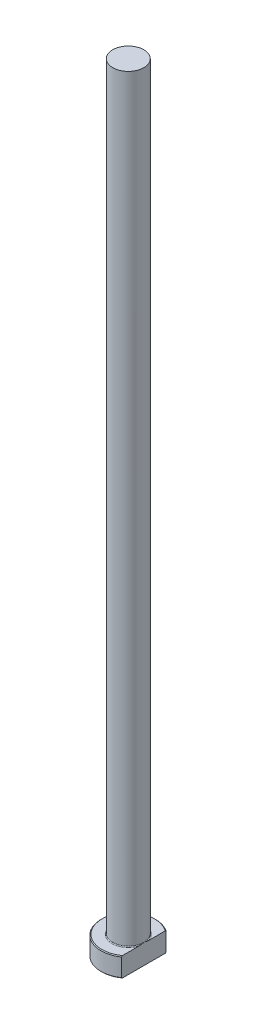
ISO-10303-21;
HEADER;
FILE_DESCRIPTION(('STEP AP214'),'2;1');
FILE_NAME('part.step','',(''),(''),'','','');
FILE_SCHEMA(('AUTOMOTIVE_DESIGN { 1 0 10303 214 1 1 1 1 }'));
ENDSEC;
DATA;
#1=APPLICATION_CONTEXT('core data for automotive mechanical design processes');
#2=APPLICATION_PROTOCOL_DEFINITION('international standard','automotive_design',2000,#1);
#3=PRODUCT_CONTEXT('',#1,'mechanical');
#4=PRODUCT('Part','Part','',(#3));
#5=PRODUCT_RELATED_PRODUCT_CATEGORY('part','',(#4));
#6=PRODUCT_DEFINITION_FORMATION('','',#4);
#7=PRODUCT_DEFINITION_CONTEXT('part definition',#1,'design');
#8=PRODUCT_DEFINITION('design','',#6,#7);
#9=PRODUCT_DEFINITION_SHAPE('','',#8);
#10=(LENGTH_UNIT() NAMED_UNIT(*) SI_UNIT(.MILLI.,.METRE.));
#11=(NAMED_UNIT(*) PLANE_ANGLE_UNIT() SI_UNIT($,.RADIAN.));
#12=(NAMED_UNIT(*) SI_UNIT($,.STERADIAN.) SOLID_ANGLE_UNIT());
#13=UNCERTAINTY_MEASURE_WITH_UNIT(LENGTH_MEASURE(1.E-05),#10,'distance_accuracy_value','');
#14=(GEOMETRIC_REPRESENTATION_CONTEXT(3) GLOBAL_UNCERTAINTY_ASSIGNED_CONTEXT((#13)) GLOBAL_UNIT_ASSIGNED_CONTEXT((#10,
#11,#12)) REPRESENTATION_CONTEXT('',''));
#15=CARTESIAN_POINT('',(0.,0.,0.));
#16=DIRECTION('',(0.,0.,1.));
#17=DIRECTION('',(1.,0.,0.));
#18=AXIS2_PLACEMENT_3D('',#15,#16,#17);
#19=CARTESIAN_POINT('',(0.,0.,0.));
#20=DIRECTION('',(0.,-1.,0.));
#21=DIRECTION('',(0.,0.,-1.));
#22=AXIS2_PLACEMENT_3D('',#19,#20,#21);
#23=PLANE('',#22);
#24=CARTESIAN_POINT('',(0.,0.,0.));
#25=DIRECTION('',(0.,-1.,0.));
#26=DIRECTION('',(0.,0.,-1.));
#27=AXIS2_PLACEMENT_3D('',#24,#25,#26);
#28=CIRCLE('',#27,6.79999999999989);
#29=CARTESIAN_POINT('',(3.99999999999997,0.,5.49909083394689));
#30=VERTEX_POINT('',#29);
#31=CARTESIAN_POINT('',(3.99999999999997,0.,-5.49909083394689));
#32=VERTEX_POINT('',#31);
#33=EDGE_CURVE('E98',#30,#32,#28,.T.);
#34=ORIENTED_EDGE('',*,*,#33,.T.);
#35=DIRECTION('',(0.,0.,1.));
#36=VECTOR('',#35,1.);
#37=CARTESIAN_POINT('',(3.99999999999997,0.,-5.74456264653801));
#38=LINE('',#37,#36);
#39=EDGE_CURVE('E83',#32,#30,#38,.T.);
#40=ORIENTED_EDGE('',*,*,#39,.T.);
#41=EDGE_LOOP('',(#34,#40));
#42=FACE_BOUND('',#41,.T.);
#43=ADVANCED_FACE('F32',(#42),#23,.T.);
#44=CARTESIAN_POINT('',(0.,259.958771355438,0.));
#45=DIRECTION('',(0.,1.,0.));
#46=DIRECTION('',(0.,0.,1.));
#47=AXIS2_PLACEMENT_3D('',#44,#45,#46);
#48=CYLINDRICAL_SURFACE('',#47,6.99999999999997);
#49=CARTESIAN_POINT('',(0.,4.79999999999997,0.));
#50=DIRECTION('',(0.,1.,0.));
#51=DIRECTION('',(0.,0.,1.));
#52=AXIS2_PLACEMENT_3D('',#49,#50,#51);
#53=CIRCLE('',#52,6.99999999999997);
#54=CARTESIAN_POINT('',(3.99999999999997,4.79999999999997,5.74456264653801));
#55=VERTEX_POINT('',#54);
#56=CARTESIAN_POINT('',(3.99999999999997,4.79999999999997,-5.74456264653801));
#57=VERTEX_POINT('',#56);
#58=EDGE_CURVE('E104',#55,#57,#53,.F.);
#59=ORIENTED_EDGE('',*,*,#58,.T.);
#60=DIRECTION('',(0.,-1.,0.));
#61=VECTOR('',#60,1.);
#62=CARTESIAN_POINT('',(3.99999999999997,200.,-5.74456264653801));
#63=LINE('',#62,#61);
#64=CARTESIAN_POINT('',(3.99999999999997,0.200000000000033,-5.74456264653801));
#65=VERTEX_POINT('',#64);
#66=EDGE_CURVE('E183',#57,#65,#63,.T.);
#67=ORIENTED_EDGE('',*,*,#66,.T.);
#68=CARTESIAN_POINT('',(0.,0.200000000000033,0.));
#69=DIRECTION('',(0.,-1.,0.));
#70=DIRECTION('',(0.,0.,-1.));
#71=AXIS2_PLACEMENT_3D('',#68,#69,#70);
#72=CIRCLE('',#71,6.99999999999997);
#73=CARTESIAN_POINT('',(3.99999999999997,0.200000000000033,5.74456264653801));
#74=VERTEX_POINT('',#73);
#75=EDGE_CURVE('E100',#65,#74,#72,.F.);
#76=ORIENTED_EDGE('',*,*,#75,.T.);
#77=DIRECTION('',(0.,-1.,0.));
#78=VECTOR('',#77,1.);
#79=CARTESIAN_POINT('',(3.99999999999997,200.,5.74456264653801));
#80=LINE('',#79,#78);
#81=EDGE_CURVE('E93',#55,#74,#80,.T.);
#82=ORIENTED_EDGE('',*,*,#81,.F.);
#83=EDGE_LOOP('',(#59,#67,#76,#82));
#84=FACE_BOUND('',#83,.T.);
#85=ADVANCED_FACE('F158',(#84),#48,.T.);
#86=CARTESIAN_POINT('',(-6.99999999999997,5.,0.));
#87=DIRECTION('',(0.,1.,0.));
#88=DIRECTION('',(0.,0.,1.));
#89=AXIS2_PLACEMENT_3D('',#86,#87,#88);
#90=PLANE('',#89);
#91=CARTESIAN_POINT('',(0.,5.,0.));
#92=DIRECTION('',(0.,1.,0.));
#93=DIRECTION('',(0.,0.,1.));
#94=AXIS2_PLACEMENT_3D('',#91,#92,#93);
#95=CIRCLE('',#94,6.79999999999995);
#96=CARTESIAN_POINT('',(3.99999999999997,5.,-5.49909083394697));
#97=VERTEX_POINT('',#96);
#98=CARTESIAN_POINT('',(3.99999999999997,5.,5.49909083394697));
#99=VERTEX_POINT('',#98);
#100=EDGE_CURVE('E178',#97,#99,#95,.T.);
#101=ORIENTED_EDGE('',*,*,#100,.T.);
#102=DIRECTION('',(0.,0.,-1.));
#103=VECTOR('',#102,1.);
#104=CARTESIAN_POINT('',(3.99999999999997,5.,0.));
#105=LINE('',#104,#103);
#106=CARTESIAN_POINT('',(3.99999999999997,4.99999999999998,1.28062484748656));
#107=VERTEX_POINT('',#106);
#108=EDGE_CURVE('E57',#99,#107,#105,.T.);
#109=ORIENTED_EDGE('',*,*,#108,.T.);
#110=CARTESIAN_POINT('',(0.,5.,0.));
#111=DIRECTION('',(0.,1.,0.));
#112=DIRECTION('',(0.,0.,1.));
#113=AXIS2_PLACEMENT_3D('',#110,#111,#112);
#114=CIRCLE('',#113,4.19999999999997);
#115=CARTESIAN_POINT('',(3.99999999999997,4.99999999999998,-1.28062484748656));
#116=VERTEX_POINT('',#115);
#117=EDGE_CURVE('E107',#107,#116,#114,.F.);
#118=ORIENTED_EDGE('',*,*,#117,.T.);
#119=EDGE_CURVE('E136',#116,#97,#105,.T.);
#120=ORIENTED_EDGE('',*,*,#119,.T.);
#121=EDGE_LOOP('',(#101,#109,#118,#120));
#122=FACE_BOUND('',#121,.T.);
#123=ADVANCED_FACE('F147',(#122),#90,.T.);
#124=CARTESIAN_POINT('',(0.,5.,0.));
#125=DIRECTION('',(0.,-1.,0.));
#126=DIRECTION('',(0.,0.,-1.));
#127=AXIS2_PLACEMENT_3D('',#124,#125,#126);
#128=CONICAL_SURFACE('',#127,6.79999999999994,0.785398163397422);
#129=ORIENTED_EDGE('',*,*,#58,.F.);
#130=CARTESIAN_POINT('',(3.99999999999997,-1.45712845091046,12.6392822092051));
#131=CARTESIAN_POINT('',(3.99999999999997,-1.24364466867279,12.4153556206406));
#132=CARTESIAN_POINT('',(3.99999999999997,-1.03042430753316,12.1911774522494));
#133=CARTESIAN_POINT('',(3.99999999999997,-0.604617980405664,11.7422167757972));
#134=CARTESIAN_POINT('',(3.99999999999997,-0.392032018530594,11.5174342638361));
#135=CARTESIAN_POINT('',(3.99999999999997,0.0324624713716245,11.0670952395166));
#136=CARTESIAN_POINT('',(3.99999999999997,0.244370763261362,10.8415385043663));
#137=CARTESIAN_POINT('',(3.99999999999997,0.667290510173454,10.3895875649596));
#138=CARTESIAN_POINT('',(3.99999999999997,0.87830196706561,10.1631933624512));
#139=CARTESIAN_POINT('',(3.99999999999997,1.51385375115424,9.4781012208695));
#140=CARTESIAN_POINT('',(3.99999999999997,1.93676291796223,9.01788214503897));
#141=CARTESIAN_POINT('',(3.99999999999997,2.5661233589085,8.32309905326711));
#142=CARTESIAN_POINT('',(3.99999999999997,2.77505666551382,8.09078457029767));
#143=CARTESIAN_POINT('',(3.99999999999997,3.19080254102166,7.62426940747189));
#144=CARTESIAN_POINT('',(3.99999999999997,3.39761512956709,7.39006874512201));
#145=CARTESIAN_POINT('',(3.99999999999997,3.87870763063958,6.83891844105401));
#146=CARTESIAN_POINT('',(3.99999999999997,4.15190978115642,6.52102188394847));
#147=CARTESIAN_POINT('',(3.99999999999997,4.55642425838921,6.03960901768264));
#148=CARTESIAN_POINT('',(3.99999999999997,4.69041050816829,5.87833992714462));
#149=CARTESIAN_POINT('',(3.99999999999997,4.9561653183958,5.55398469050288));
#150=CARTESIAN_POINT('',(3.99999999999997,5.08793391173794,5.39089857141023));
#151=CARTESIAN_POINT('',(3.99999999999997,5.34841712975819,5.06288801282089));
#152=CARTESIAN_POINT('',(3.99999999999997,5.47713786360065,4.89796843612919));
#153=CARTESIAN_POINT('',(3.99999999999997,5.73107494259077,4.56545535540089));
#154=CARTESIAN_POINT('',(3.99999999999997,5.85629144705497,4.39786197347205));
#155=CARTESIAN_POINT('',(3.99999999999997,6.10211465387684,4.05948444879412));
#156=CARTESIAN_POINT('',(3.99999999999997,6.22272435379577,3.88870249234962));
#157=CARTESIAN_POINT('',(3.99999999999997,6.45796076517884,3.54308312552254));
#158=CARTESIAN_POINT('',(3.99999999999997,6.57258867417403,3.36824653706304));
#159=CARTESIAN_POINT('',(3.99999999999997,6.76866603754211,3.05381396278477));
#160=CARTESIAN_POINT('',(3.99999999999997,6.85173773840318,2.91523359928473));
#161=CARTESIAN_POINT('',(3.99999999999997,7.0117453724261,2.63451965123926));
#162=CARTESIAN_POINT('',(3.99999999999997,7.08868042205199,2.49238555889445));
#163=CARTESIAN_POINT('',(3.99999999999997,7.23459437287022,2.20416961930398));
#164=CARTESIAN_POINT('',(3.99999999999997,7.30357836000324,2.05809037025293));
#165=CARTESIAN_POINT('',(3.99999999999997,7.4313552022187,1.76151732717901));
#166=CARTESIAN_POINT('',(3.99999999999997,7.49015114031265,1.61102488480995));
#167=CARTESIAN_POINT('',(3.99999999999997,7.58249315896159,1.341420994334));
#168=CARTESIAN_POINT('',(3.99999999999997,7.61872660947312,1.2232350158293));
#169=CARTESIAN_POINT('',(3.99999999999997,7.68223354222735,0.984492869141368));
#170=CARTESIAN_POINT('',(3.99999999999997,7.70951040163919,0.863937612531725));
#171=CARTESIAN_POINT('',(3.99999999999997,7.75377914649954,0.621342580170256));
#172=CARTESIAN_POINT('',(3.99999999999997,7.77080509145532,0.499309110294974));
#173=CARTESIAN_POINT('',(3.99999999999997,7.79378778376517,0.254194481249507));
#174=CARTESIAN_POINT('',(3.99999999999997,7.79974523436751,0.131113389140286));
#175=CARTESIAN_POINT('',(3.99999999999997,7.80023957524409,-0.115517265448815));
#176=CARTESIAN_POINT('',(3.99999999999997,7.79473514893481,-0.239066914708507));
#177=CARTESIAN_POINT('',(3.99999999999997,7.77255119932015,-0.485148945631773));
#178=CARTESIAN_POINT('',(3.99999999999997,7.75587091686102,-0.607681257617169));
#179=CARTESIAN_POINT('',(3.99999999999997,7.71218353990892,-0.851269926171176));
#180=CARTESIAN_POINT('',(3.99999999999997,7.68514362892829,-0.972320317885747));
#181=CARTESIAN_POINT('',(3.99999999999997,7.62201202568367,-1.21200276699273));
#182=CARTESIAN_POINT('',(3.99999999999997,7.58591962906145,-1.33063463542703));
#183=CARTESIAN_POINT('',(3.99999999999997,7.45980070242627,-1.70122439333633));
#184=CARTESIAN_POINT('',(3.99999999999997,7.3557295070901,-1.94843335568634));
#185=CARTESIAN_POINT('',(3.99999999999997,7.18186715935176,-2.31048534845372));
#186=CARTESIAN_POINT('',(3.99999999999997,7.12087684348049,-2.429835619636));
#187=CARTESIAN_POINT('',(3.99999999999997,6.99403531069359,-2.66593629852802));
#188=CARTESIAN_POINT('',(3.99999999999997,6.92818466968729,-2.78268701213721));
#189=CARTESIAN_POINT('',(3.99999999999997,6.7915787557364,-3.01550895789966));
#190=CARTESIAN_POINT('',(3.99999999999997,6.7207668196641,-3.13154660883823));
#191=CARTESIAN_POINT('',(3.99999999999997,6.57583116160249,-3.36153379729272));
#192=CARTESIAN_POINT('',(3.99999999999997,6.5017073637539,-3.47548328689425));
#193=CARTESIAN_POINT('',(3.99999999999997,6.35080982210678,-3.70145107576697));
#194=CARTESIAN_POINT('',(3.99999999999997,6.27403866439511,-3.81347110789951));
#195=CARTESIAN_POINT('',(3.99999999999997,6.11824120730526,-4.03592316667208));
#196=CARTESIAN_POINT('',(3.99999999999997,6.03921496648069,-4.14635523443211));
#197=CARTESIAN_POINT('',(3.99999999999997,5.81506547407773,-4.45397159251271));
#198=CARTESIAN_POINT('',(3.99999999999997,5.66782256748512,-4.64961120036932));
#199=CARTESIAN_POINT('',(3.99999999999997,5.36880597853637,-5.03740600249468));
#200=CARTESIAN_POINT('',(3.99999999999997,5.21703183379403,-5.22956083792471));
#201=CARTESIAN_POINT('',(3.99999999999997,4.909991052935,-5.6111546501));
#202=CARTESIAN_POINT('',(3.99999999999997,4.754723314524,-5.80059273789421));
#203=CARTESIAN_POINT('',(3.99999999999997,4.44150758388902,-6.17724364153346));
#204=CARTESIAN_POINT('',(3.99999999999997,4.28355951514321,-6.36445639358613));
#205=CARTESIAN_POINT('',(3.99999999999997,3.96525805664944,-6.73740614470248));
#206=CARTESIAN_POINT('',(3.99999999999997,3.80490084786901,-6.92313987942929));
#207=CARTESIAN_POINT('',(3.99999999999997,3.48247055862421,-7.29311320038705));
#208=CARTESIAN_POINT('',(3.99999999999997,3.32039746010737,-7.47735277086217));
#209=CARTESIAN_POINT('',(3.99999999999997,2.83216188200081,-8.02814826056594));
#210=CARTESIAN_POINT('',(3.99999999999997,2.50391696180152,-8.39285790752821));
#211=CARTESIAN_POINT('',(3.99999999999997,1.87512078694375,-9.08414492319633));
#212=CARTESIAN_POINT('',(3.99999999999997,1.57491666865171,-9.41103929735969));
#213=CARTESIAN_POINT('',(3.99999999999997,0.972153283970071,-10.0626830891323));
#214=CARTESIAN_POINT('',(3.99999999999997,0.669593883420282,-10.387432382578));
#215=CARTESIAN_POINT('',(3.99999999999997,0.0637759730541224,-11.0341169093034));
#216=CARTESIAN_POINT('',(3.99999999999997,-0.23947625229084,-11.3560580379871));
#217=CARTESIAN_POINT('',(3.99999999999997,-0.847356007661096,-11.9985921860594));
#218=CARTESIAN_POINT('',(3.99999999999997,-1.15198342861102,-12.3191853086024));
#219=CARTESIAN_POINT('',(3.99999999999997,-1.45712845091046,-12.6392822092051));
#220=B_SPLINE_CURVE_WITH_KNOTS('',3,(#130,#131,#132,#133,#134,#135,#136,#137,#138,#139,#140,
#141,#142,#143,#144,#145,#146,#147,#148,#149,#150,#151,#152,#153,#154,#155,#156,#157,#158,#159,
#160,#161,#162,#163,#164,#165,#166,#167,#168,#169,#170,#171,#172,#173,#174,#175,#176,#177,#178,
#179,#180,#181,#182,#183,#184,#185,#186,#187,#188,#189,#190,#191,#192,#193,#194,#195,#196,#197,
#198,#199,#200,#201,#202,#203,#204,#205,#206,#207,#208,#209,#210,#211,#212,#213,#214,#215,#216,
#217,#218,#219),.UNSPECIFIED.,.F.,.F.,(4,2,2,2,2,2,2,2,2,2,2,2,2,2,2,2,2,2,2,2,2,2,2,2,2,2,2,2,
2,2,2,2,2,2,2,2,2,2,2,2,2,2,2,2,4),(0.,0.928152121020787,1.85631024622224,2.7847626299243,
3.71321307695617,5.58823033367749,6.52556078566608,7.46288254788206,8.72028576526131,
9.34927045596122,9.97824580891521,10.6058302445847,11.2333861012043,11.8605264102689,
12.4875406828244,12.972136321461,13.4568016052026,13.9411551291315,14.4253618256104,
14.7959147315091,15.1663277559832,15.5355031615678,15.904655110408,16.2751400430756,
16.6456501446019,17.0173437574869,17.3890663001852,18.1913996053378,18.5934522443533,
18.9954573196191,19.4032100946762,19.8109722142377,20.2183467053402,20.6257106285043,
21.3601838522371,22.0947322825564,22.8295158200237,23.5643203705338,24.3004480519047,
25.036583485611,26.508549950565,27.8400191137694,29.1715646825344,30.4983881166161,
31.8251080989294),.UNSPECIFIED.);
#221=EDGE_CURVE('E135',#55,#99,#220,.T.);
#222=ORIENTED_EDGE('',*,*,#221,.T.);
#223=ORIENTED_EDGE('',*,*,#100,.F.);
#224=EDGE_CURVE('E127',#97,#57,#220,.T.);
#225=ORIENTED_EDGE('',*,*,#224,.T.);
#226=EDGE_LOOP('',(#129,#222,#223,#225));
#227=FACE_BOUND('',#226,.T.);
#228=ADVANCED_FACE('F143',(#227),#128,.T.);
#229=CARTESIAN_POINT('',(0.,0.200000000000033,0.));
#230=DIRECTION('',(0.,1.,0.));
#231=DIRECTION('',(0.,0.,1.));
#232=AXIS2_PLACEMENT_3D('',#229,#230,#231);
#233=CONICAL_SURFACE('',#232,6.99999999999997,0.785398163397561);
#234=ORIENTED_EDGE('',*,*,#75,.F.);
#235=CARTESIAN_POINT('',(3.99999999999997,6.45712845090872,-12.6392822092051));
#236=CARTESIAN_POINT('',(3.99999999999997,6.24364466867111,-12.4153556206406));
#237=CARTESIAN_POINT('',(3.99999999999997,6.03042430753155,-12.1911774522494));
#238=CARTESIAN_POINT('',(3.99999999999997,5.60461798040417,-11.7422167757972));
#239=CARTESIAN_POINT('',(3.99999999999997,5.39203201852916,-11.5174342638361));
#240=CARTESIAN_POINT('',(3.99999999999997,4.96753752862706,-11.0670952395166));
#241=CARTESIAN_POINT('',(3.99999999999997,4.75562923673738,-10.8415385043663));
#242=CARTESIAN_POINT('',(3.99999999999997,4.3327094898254,-10.3895875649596));
#243=CARTESIAN_POINT('',(3.99999999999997,4.12169803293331,-10.1631933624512));
#244=CARTESIAN_POINT('',(3.99999999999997,3.48614624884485,-9.47810122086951));
#245=CARTESIAN_POINT('',(3.99999999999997,3.06323708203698,-9.01788214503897));
#246=CARTESIAN_POINT('',(3.99999999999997,2.43387664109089,-8.32309905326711));
#247=CARTESIAN_POINT('',(3.99999999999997,2.22494333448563,-8.09078457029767));
#248=CARTESIAN_POINT('',(3.99999999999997,1.8091974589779,-7.6242694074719));
#249=CARTESIAN_POINT('',(3.99999999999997,1.60238487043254,-7.39006874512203));
#250=CARTESIAN_POINT('',(3.99999999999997,1.1212923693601,-6.83891844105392));
#251=CARTESIAN_POINT('',(3.99999999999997,0.848090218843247,-6.52102188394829));
#252=CARTESIAN_POINT('',(3.99999999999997,0.443575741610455,-6.03960901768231));
#253=CARTESIAN_POINT('',(3.99999999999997,0.30958949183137,-5.87833992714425));
#254=CARTESIAN_POINT('',(3.99999999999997,0.0438346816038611,-5.5539846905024));
#255=CARTESIAN_POINT('',(3.99999999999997,-0.0879339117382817,-5.3908985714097));
#256=CARTESIAN_POINT('',(3.99999999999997,-0.348417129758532,-5.06288801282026));
#257=CARTESIAN_POINT('',(3.99999999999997,-0.477137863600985,-4.8979684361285));
#258=CARTESIAN_POINT('',(3.99999999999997,-0.731074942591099,-4.5654553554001));
#259=CARTESIAN_POINT('',(3.99999999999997,-0.856291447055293,-4.39786197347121));
#260=CARTESIAN_POINT('',(3.99999999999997,-1.10211465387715,-4.05948444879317));
#261=CARTESIAN_POINT('',(3.99999999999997,-1.22272435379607,-3.88870249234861));
#262=CARTESIAN_POINT('',(3.99999999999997,-1.45796076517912,-3.54308312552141));
#263=CARTESIAN_POINT('',(3.99999999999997,-1.57258867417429,-3.36824653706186));
#264=CARTESIAN_POINT('',(3.99999999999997,-1.76866603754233,-3.05381396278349));
#265=CARTESIAN_POINT('',(3.99999999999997,-1.85173773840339,-2.9152335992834));
#266=CARTESIAN_POINT('',(3.99999999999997,-2.01174537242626,-2.63451965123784));
#267=CARTESIAN_POINT('',(3.99999999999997,-2.08868042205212,-2.49238555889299));
#268=CARTESIAN_POINT('',(3.99999999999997,-2.23459437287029,-2.20416961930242));
#269=CARTESIAN_POINT('',(3.99999999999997,-2.30357836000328,-2.05809037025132));
#270=CARTESIAN_POINT('',(3.99999999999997,-2.43135520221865,-1.76151732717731));
#271=CARTESIAN_POINT('',(3.99999999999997,-2.49015114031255,-1.6110248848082));
#272=CARTESIAN_POINT('',(3.99999999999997,-2.58249315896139,-1.34142099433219));
#273=CARTESIAN_POINT('',(3.99999999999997,-2.61872660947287,-1.22323501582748));
#274=CARTESIAN_POINT('',(3.99999999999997,-2.68223354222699,-0.984492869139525));
#275=CARTESIAN_POINT('',(3.99999999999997,-2.70951040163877,-0.863937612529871));
#276=CARTESIAN_POINT('',(3.99999999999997,-2.75377914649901,-0.621342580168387));
#277=CARTESIAN_POINT('',(3.99999999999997,-2.77080509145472,-0.499309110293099));
#278=CARTESIAN_POINT('',(3.99999999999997,-2.79378778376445,-0.254194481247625));
#279=CARTESIAN_POINT('',(3.99999999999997,-2.79974523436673,-0.131113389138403));
#280=CARTESIAN_POINT('',(3.99999999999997,-2.8002395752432,0.115517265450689));
#281=CARTESIAN_POINT('',(3.99999999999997,-2.79473514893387,0.239066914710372));
#282=CARTESIAN_POINT('',(3.99999999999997,-2.7725511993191,0.485148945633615));
#283=CARTESIAN_POINT('',(3.99999999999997,-2.75587091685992,0.607681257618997));
#284=CARTESIAN_POINT('',(3.99999999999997,-2.71218353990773,0.851269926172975));
#285=CARTESIAN_POINT('',(3.99999999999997,-2.68514362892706,0.97232031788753));
#286=CARTESIAN_POINT('',(3.99999999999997,-2.62201202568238,1.21200276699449));
#287=CARTESIAN_POINT('',(3.99999999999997,-2.58591962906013,1.33063463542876));
#288=CARTESIAN_POINT('',(3.99999999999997,-2.45980070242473,1.70122439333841));
#289=CARTESIAN_POINT('',(3.99999999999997,-2.35572950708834,1.94843335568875));
#290=CARTESIAN_POINT('',(3.99999999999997,-2.18186715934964,2.31048534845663));
#291=CARTESIAN_POINT('',(3.99999999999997,-2.12087684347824,2.42983561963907));
#292=CARTESIAN_POINT('',(3.99999999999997,-1.9940353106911,2.66593629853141));
#293=CARTESIAN_POINT('',(3.99999999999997,-1.92818466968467,2.78268701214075));
#294=CARTESIAN_POINT('',(3.99999999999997,-1.79157875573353,3.01550895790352));
#295=CARTESIAN_POINT('',(3.99999999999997,-1.72076681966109,3.13154660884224));
#296=CARTESIAN_POINT('',(3.99999999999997,-1.57583116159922,3.36153379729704));
#297=CARTESIAN_POINT('',(3.99999999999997,-1.50170736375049,3.47548328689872));
#298=CARTESIAN_POINT('',(3.99999999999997,-1.35080982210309,3.70145107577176));
#299=CARTESIAN_POINT('',(3.99999999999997,-1.27403866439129,3.81347110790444));
#300=CARTESIAN_POINT('',(3.99999999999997,-1.11824120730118,4.03592316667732));
#301=CARTESIAN_POINT('',(3.99999999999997,-1.03921496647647,4.1463552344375));
#302=CARTESIAN_POINT('',(3.99999999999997,-0.815065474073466,4.45397159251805));
#303=CARTESIAN_POINT('',(3.99999999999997,-0.667822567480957,4.64961120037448));
#304=CARTESIAN_POINT('',(3.99999999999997,-0.368805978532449,5.03740600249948));
#305=CARTESIAN_POINT('',(3.99999999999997,-0.217031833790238,5.22956083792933));
#306=CARTESIAN_POINT('',(3.99999999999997,0.090008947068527,5.61115465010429));
#307=CARTESIAN_POINT('',(3.99999999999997,0.245276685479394,5.80059273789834));
#308=CARTESIAN_POINT('',(3.99999999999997,0.558492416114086,6.17724364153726));
#309=CARTESIAN_POINT('',(3.99999999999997,0.716440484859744,6.36445639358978));
#310=CARTESIAN_POINT('',(3.99999999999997,1.03474194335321,6.73740614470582));
#311=CARTESIAN_POINT('',(3.99999999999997,1.19509915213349,6.92313987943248));
#312=CARTESIAN_POINT('',(3.99999999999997,1.51752944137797,7.29311320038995));
#313=CARTESIAN_POINT('',(3.99999999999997,1.67960253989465,7.47735277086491));
#314=CARTESIAN_POINT('',(3.99999999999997,2.16783811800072,8.02814826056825));
#315=CARTESIAN_POINT('',(3.99999999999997,2.49608303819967,8.39285790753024));
#316=CARTESIAN_POINT('',(3.99999999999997,3.1248792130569,9.08414492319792));
#317=CARTESIAN_POINT('',(3.99999999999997,3.42508333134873,9.41103929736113));
#318=CARTESIAN_POINT('',(3.99999999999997,4.02784671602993,10.0626830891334));
#319=CARTESIAN_POINT('',(3.99999999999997,4.3304061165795,10.387432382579));
#320=CARTESIAN_POINT('',(3.99999999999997,4.93622402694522,11.0341169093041));
#321=CARTESIAN_POINT('',(3.99999999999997,5.23947625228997,11.3560580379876));
#322=CARTESIAN_POINT('',(3.99999999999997,5.8473560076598,11.9985921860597));
#323=CARTESIAN_POINT('',(3.99999999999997,6.1519834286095,12.3191853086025));
#324=CARTESIAN_POINT('',(3.99999999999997,6.45712845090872,12.6392822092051));
#325=B_SPLINE_CURVE_WITH_KNOTS('',3,(#235,#236,#237,#238,#239,#240,#241,#242,#243,#244,#245,
#246,#247,#248,#249,#250,#251,#252,#253,#254,#255,#256,#257,#258,#259,#260,#261,#262,#263,#264,
#265,#266,#267,#268,#269,#270,#271,#272,#273,#274,#275,#276,#277,#278,#279,#280,#281,#282,#283,
#284,#285,#286,#287,#288,#289,#290,#291,#292,#293,#294,#295,#296,#297,#298,#299,#300,#301,#302,
#303,#304,#305,#306,#307,#308,#309,#310,#311,#312,#313,#314,#315,#316,#317,#318,#319,#320,#321,
#322,#323,#324),.UNSPECIFIED.,.F.,.F.,(4,2,2,2,2,2,2,2,2,2,2,2,2,2,2,2,2,2,2,2,2,2,2,2,2,2,2,2,
2,2,2,2,2,2,2,2,2,2,2,2,2,2,2,2,4),(0.,0.928152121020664,1.85631024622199,2.78476262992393,
3.71321307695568,5.58823033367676,6.52556078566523,7.46288254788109,8.72028576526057,
9.34927045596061,9.97824580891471,10.6058302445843,11.233386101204,11.8605264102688,
12.4875406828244,12.9721363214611,13.4568016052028,13.9411551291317,14.4253618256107,
14.7959147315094,15.1663277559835,15.5355031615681,15.9046551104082,16.2751400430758,
16.6456501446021,17.0173437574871,17.3890663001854,18.1913996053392,18.5934522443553,
18.9954573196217,19.4032100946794,19.8109722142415,20.2183467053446,20.6257106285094,
21.3601838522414,22.0947322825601,22.8295158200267,23.5643203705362,24.3004480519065,
25.0365834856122,26.5085499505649,27.8400191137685,29.1715646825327,30.4983881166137,
31.8251080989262),.UNSPECIFIED.);
#326=EDGE_CURVE('E86',#65,#32,#325,.T.);
#327=ORIENTED_EDGE('',*,*,#326,.T.);
#328=ORIENTED_EDGE('',*,*,#33,.F.);
#329=EDGE_CURVE('E89',#30,#74,#325,.T.);
#330=ORIENTED_EDGE('',*,*,#329,.T.);
#331=EDGE_LOOP('',(#234,#327,#328,#330));
#332=FACE_BOUND('',#331,.T.);
#333=ADVANCED_FACE('F97',(#332),#233,.T.);
#334=CARTESIAN_POINT('',(0.,5.19999999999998,0.));
#335=DIRECTION('',(0.,1.,0.));
#336=DIRECTION('',(0.,0.,1.));
#337=AXIS2_PLACEMENT_3D('',#334,#335,#336);
#338=TOROIDAL_SURFACE('',#337,4.19999999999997,0.2);
#339=CARTESIAN_POINT('',(3.99999999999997,5.19999999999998,0.));
#340=CARTESIAN_POINT('',(3.99999999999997,5.20000051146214,6.55036346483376E-12));
#341=CARTESIAN_POINT('',(3.99999999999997,5.20000102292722,-2.33849506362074E-07));
#342=CARTESIAN_POINT('',(3.99999999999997,5.20000197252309,-8.59106878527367E-07));
#343=CARTESIAN_POINT('',(3.99999999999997,5.20000239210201,-1.26721104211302E-06));
#344=CARTESIAN_POINT('',(3.99999999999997,5.2000032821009,-2.25074272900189E-06));
#345=CARTESIAN_POINT('',(3.99999999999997,5.20000373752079,-2.84212509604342E-06));
#346=CARTESIAN_POINT('',(3.99999999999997,5.20000453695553,-4.0532804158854E-06));
#347=CARTESIAN_POINT('',(3.99999999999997,5.20000488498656,-4.67066373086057E-06));
#348=CARTESIAN_POINT('',(3.99999999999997,5.20000621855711,-7.11716595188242E-06));
#349=CARTESIAN_POINT('',(3.99999999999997,5.20000713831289,-8.9855846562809E-06));
#350=CARTESIAN_POINT('',(3.99999999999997,5.20000861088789,-1.26418241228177E-05));
#351=CARTESIAN_POINT('',(3.99999999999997,5.20000919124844,-1.44189478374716E-05));
#352=CARTESIAN_POINT('',(3.99999999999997,5.20001169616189,-2.20915834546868E-05));
#353=CARTESIAN_POINT('',(3.99999999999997,5.20001361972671,-2.79894745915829E-05));
#354=CARTESIAN_POINT('',(3.99999999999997,5.20001638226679,-3.90228530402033E-05));
#355=CARTESIAN_POINT('',(3.99999999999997,5.20001734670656,-4.41264575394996E-05));
#356=CARTESIAN_POINT('',(3.99999999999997,5.20002447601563,-8.24800894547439E-05));
#357=CARTESIAN_POINT('',(3.99999999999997,5.20003000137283,-0.000115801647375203));
#358=CARTESIAN_POINT('',(3.99999999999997,5.20005417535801,-0.000248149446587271));
#359=CARTESIAN_POINT('',(3.99999999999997,5.20007711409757,-0.00034639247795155));
#360=CARTESIAN_POINT('',(3.99999999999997,5.20016695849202,-0.000737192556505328));
#361=CARTESIAN_POINT('',(3.99999999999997,5.2002311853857,-0.00103015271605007));
#362=CARTESIAN_POINT('',(3.99999999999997,5.20048943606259,-0.00220000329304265));
#363=CARTESIAN_POINT('',(3.99999999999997,5.20068689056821,-0.00307635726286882));
#364=CARTESIAN_POINT('',(3.99999999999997,5.2015124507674,-0.00674945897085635));
#365=CARTESIAN_POINT('',(3.99999999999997,5.20213623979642,-0.00954688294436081));
#366=CARTESIAN_POINT('',(3.99999999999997,5.21069858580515,-0.0479346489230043));
#367=CARTESIAN_POINT('',(3.99999999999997,5.21866411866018,-0.083521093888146));
#368=CARTESIAN_POINT('',(3.99999999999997,5.23536251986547,-0.158673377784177));
#369=CARTESIAN_POINT('',(3.99999999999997,5.24408230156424,-0.198242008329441));
#370=CARTESIAN_POINT('',(3.99999999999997,5.25875222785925,-0.265746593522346));
#371=CARTESIAN_POINT('',(3.99999999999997,5.264760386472,-0.293669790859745));
#372=CARTESIAN_POINT('',(3.99999999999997,5.27645424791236,-0.348796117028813));
#373=CARTESIAN_POINT('',(3.99999999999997,5.2821442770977,-0.375998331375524));
#374=CARTESIAN_POINT('',(3.99999999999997,5.30043795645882,-0.465036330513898));
#375=CARTESIAN_POINT('',(3.99999999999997,5.31263876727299,-0.526956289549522));
#376=CARTESIAN_POINT('',(3.99999999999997,5.33561275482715,-0.65168218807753));
#377=CARTESIAN_POINT('',(3.99999999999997,5.34637105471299,-0.714490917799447));
#378=CARTESIAN_POINT('',(3.99999999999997,5.36658245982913,-0.846543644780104));
#379=CARTESIAN_POINT('',(3.99999999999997,5.37580902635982,-0.915823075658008));
#380=CARTESIAN_POINT('',(3.99999999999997,5.39039845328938,-1.05460878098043));
#381=CARTESIAN_POINT('',(3.99999999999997,5.39577328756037,-1.12411367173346));
#382=CARTESIAN_POINT('',(3.99999999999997,5.39959291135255,-1.22750409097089));
#383=CARTESIAN_POINT('',(3.99999999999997,5.40018074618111,-1.26130913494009));
#384=CARTESIAN_POINT('',(3.99999999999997,5.39972074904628,-1.32890426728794));
#385=CARTESIAN_POINT('',(3.99999999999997,5.39867346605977,-1.36269435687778));
#386=CARTESIAN_POINT('',(3.99999999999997,5.39455571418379,-1.42954089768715));
#387=CARTESIAN_POINT('',(3.99999999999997,5.39152235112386,-1.46259952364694));
#388=CARTESIAN_POINT('',(3.99999999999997,5.38286512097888,-1.52835908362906));
#389=CARTESIAN_POINT('',(3.99999999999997,5.37724516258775,-1.56106048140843));
#390=CARTESIAN_POINT('',(3.99999999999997,5.36402263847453,-1.61846409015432));
#391=CARTESIAN_POINT('',(3.99999999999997,5.35713757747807,-1.64332989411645));
#392=CARTESIAN_POINT('',(3.99999999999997,5.34027199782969,-1.69212725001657));
#393=CARTESIAN_POINT('',(3.99999999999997,5.33028876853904,-1.7160579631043));
#394=CARTESIAN_POINT('',(3.99999999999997,5.31168601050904,-1.75008824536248));
#395=CARTESIAN_POINT('',(3.99999999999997,5.30485398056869,-1.76115159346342));
#396=CARTESIAN_POINT('',(3.99999999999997,5.28960114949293,-1.78210611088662));
#397=CARTESIAN_POINT('',(3.99999999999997,5.28118962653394,-1.79200360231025));
#398=CARTESIAN_POINT('',(3.99999999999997,5.26737388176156,-1.80493475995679));
#399=CARTESIAN_POINT('',(3.99999999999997,5.26276322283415,-1.80881084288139));
#400=CARTESIAN_POINT('',(3.99999999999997,5.25306023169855,-1.81592390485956));
#401=CARTESIAN_POINT('',(3.99999999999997,5.24796771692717,-1.81916064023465));
#402=CARTESIAN_POINT('',(3.99999999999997,5.23724406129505,-1.82480514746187));
#403=CARTESIAN_POINT('',(3.99999999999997,5.23160666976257,-1.82720134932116));
#404=CARTESIAN_POINT('',(3.99999999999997,5.219971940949,-1.83083611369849));
#405=CARTESIAN_POINT('',(3.99999999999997,5.21397550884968,-1.83207746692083));
#406=CARTESIAN_POINT('',(3.99999999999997,5.20263132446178,-1.83315692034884));
#407=CARTESIAN_POINT('',(3.99999999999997,5.19729868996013,-1.8331541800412));
#408=CARTESIAN_POINT('',(3.99999999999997,5.18672944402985,-1.83214057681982));
#409=CARTESIAN_POINT('',(3.99999999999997,5.18149289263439,-1.83112910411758));
#410=CARTESIAN_POINT('',(3.99999999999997,5.17078487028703,-1.82806907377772));
#411=CARTESIAN_POINT('',(3.99999999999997,5.16533999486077,-1.82592931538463));
#412=CARTESIAN_POINT('',(3.99999999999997,5.1548729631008,-1.82079411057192));
#413=CARTESIAN_POINT('',(3.99999999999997,5.14985146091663,-1.81779737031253));
#414=CARTESIAN_POINT('',(3.99999999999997,5.13773920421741,-1.80942140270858));
#415=CARTESIAN_POINT('',(3.99999999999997,5.13094534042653,-1.80361715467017));
#416=CARTESIAN_POINT('',(3.99999999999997,5.11830005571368,-1.79106454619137));
#417=CARTESIAN_POINT('',(3.99999999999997,5.11245134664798,-1.78431356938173));
#418=CARTESIAN_POINT('',(3.99999999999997,5.09656788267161,-1.76377799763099));
#419=CARTESIAN_POINT('',(3.99999999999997,5.08757958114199,-1.74919341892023));
#420=CARTESIAN_POINT('',(3.99999999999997,5.07165230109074,-1.71899459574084));
#421=CARTESIAN_POINT('',(3.99999999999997,5.064716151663,-1.70337896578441));
#422=CARTESIAN_POINT('',(3.99999999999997,5.04964646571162,-1.66459665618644));
#423=CARTESIAN_POINT('',(3.99999999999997,5.04232016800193,-1.64111968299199));
#424=CARTESIAN_POINT('',(3.99999999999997,5.02986383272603,-1.59357415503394));
#425=CARTESIAN_POINT('',(3.99999999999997,5.02473853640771,-1.56950444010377));
#426=CARTESIAN_POINT('',(3.99999999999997,5.0161032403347,-1.52067485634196));
#427=CARTESIAN_POINT('',(3.99999999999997,5.01262117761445,-1.49591014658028));
#428=CARTESIAN_POINT('',(3.99999999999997,5.00704256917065,-1.44626562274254));
#429=CARTESIAN_POINT('',(3.99999999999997,5.00494421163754,-1.42138600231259));
#430=CARTESIAN_POINT('',(3.99999999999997,5.00075077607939,-1.35341124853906));
#431=CARTESIAN_POINT('',(3.99999999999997,4.99977133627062,-1.31024782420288));
#432=CARTESIAN_POINT('',(3.99999999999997,5.00031303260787,-1.22392963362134));
#433=CARTESIAN_POINT('',(3.99999999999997,5.00183577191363,-1.18077489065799));
#434=CARTESIAN_POINT('',(3.99999999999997,5.00931890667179,-1.05109835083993));
#435=CARTESIAN_POINT('',(3.99999999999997,5.01820648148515,-0.964749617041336));
#436=CARTESIAN_POINT('',(3.99999999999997,5.03989342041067,-0.800200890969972));
#437=CARTESIAN_POINT('',(3.99999999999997,5.05228816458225,-0.721941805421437));
#438=CARTESIAN_POINT('',(3.99999999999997,5.07962880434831,-0.566748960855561));
#439=CARTESIAN_POINT('',(3.99999999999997,5.09454562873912,-0.4898100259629));
#440=CARTESIAN_POINT('',(3.99999999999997,5.115946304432,-0.385191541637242));
#441=CARTESIAN_POINT('',(3.99999999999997,5.12174621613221,-0.357366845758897));
#442=CARTESIAN_POINT('',(3.99999999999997,5.13367824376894,-0.300962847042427));
#443=CARTESIAN_POINT('',(3.99999999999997,5.13981511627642,-0.272384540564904));
#444=CARTESIAN_POINT('',(3.99999999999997,5.15483459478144,-0.203169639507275));
#445=CARTESIAN_POINT('',(3.99999999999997,5.16378036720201,-0.1625469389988));
#446=CARTESIAN_POINT('',(3.99999999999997,5.18091599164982,-0.0854009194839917));
#447=CARTESIAN_POINT('',(3.99999999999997,5.18909179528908,-0.0488746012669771));
#448=CARTESIAN_POINT('',(3.99999999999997,5.19786384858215,-0.00954647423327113));
#449=CARTESIAN_POINT('',(3.99999999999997,5.19848773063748,-0.0067486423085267));
#450=CARTESIAN_POINT('',(3.99999999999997,5.19931331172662,-0.00307545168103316));
#451=CARTESIAN_POINT('',(3.99999999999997,5.19951069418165,-0.00219941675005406));
#452=CARTESIAN_POINT('',(3.99999999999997,5.19976885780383,-0.00102996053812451));
#453=CARTESIAN_POINT('',(3.99999999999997,5.199833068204,-0.000737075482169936));
#454=CARTESIAN_POINT('',(3.99999999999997,5.19992289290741,-0.00034636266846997));
#455=CARTESIAN_POINT('',(3.99999999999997,5.19994582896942,-0.000248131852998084));
#456=CARTESIAN_POINT('',(3.99999999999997,5.19997000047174,-0.000115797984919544));
#457=CARTESIAN_POINT('',(3.99999999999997,5.19997552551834,-8.24780552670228E-05));
#458=CARTESIAN_POINT('',(3.99999999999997,5.19998265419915,-4.4126093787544E-05));
#459=CARTESIAN_POINT('',(3.99999999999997,5.19998361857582,-3.90225725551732E-05));
#460=CARTESIAN_POINT('',(3.99999999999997,5.19998638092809,-2.79893703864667E-05));
#461=CARTESIAN_POINT('',(3.99999999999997,5.19998830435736,-2.20915678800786E-05));
#462=CARTESIAN_POINT('',(3.99999999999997,5.19999080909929,-1.44190255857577E-05));
#463=CARTESIAN_POINT('',(3.99999999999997,5.19999138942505,-1.26419078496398E-05));
#464=CARTESIAN_POINT('',(3.99999999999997,5.19999286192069,-8.98567517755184E-06));
#465=CARTESIAN_POINT('',(3.99999999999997,5.1999937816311,-7.1172564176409E-06));
#466=CARTESIAN_POINT('',(3.99999999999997,5.19999511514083,-4.67074826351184E-06));
#467=CARTESIAN_POINT('',(3.99999999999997,5.19999546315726,-4.05336147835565E-06));
#468=CARTESIAN_POINT('',(3.99999999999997,5.19999626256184,-2.84219658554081E-06));
#469=CARTESIAN_POINT('',(3.99999999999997,5.19999671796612,-2.25080798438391E-06));
#470=CARTESIAN_POINT('',(3.99999999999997,5.19999760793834,-1.26726200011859E-06));
#471=CARTESIAN_POINT('',(3.99999999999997,5.19999802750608,-8.59150369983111E-07));
#472=CARTESIAN_POINT('',(3.99999999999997,5.19999897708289,-2.33873741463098E-07));
#473=CARTESIAN_POINT('',(3.99999999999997,5.19999948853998,-6.55033592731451E-12));
#474=CARTESIAN_POINT('',(3.99999999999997,5.19999999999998,0.));
#475=B_SPLINE_CURVE_WITH_KNOTS('',3,(#339,#340,#341,#342,#343,#344,#345,#346,#347,#348,#349,
#350,#351,#352,#353,#354,#355,#356,#357,#358,#359,#360,#361,#362,#363,#364,#365,#366,#367,#368,
#369,#370,#371,#372,#373,#374,#375,#376,#377,#378,#379,#380,#381,#382,#383,#384,#385,#386,#387,
#388,#389,#390,#391,#392,#393,#394,#395,#396,#397,#398,#399,#400,#401,#402,#403,#404,#405,#406,
#407,#408,#409,#410,#411,#412,#413,#414,#415,#416,#417,#418,#419,#420,#421,#422,#423,#424,#425,
#426,#427,#428,#429,#430,#431,#432,#433,#434,#435,#436,#437,#438,#439,#440,#441,#442,#443,#444,
#445,#446,#447,#448,#449,#450,#451,#452,#453,#454,#455,#456,#457,#458,#459,#460,#461,#462,#463,
#464,#465,#466,#467,#468,#469,#470,#471,#472,#473,#474),.UNSPECIFIED.,.T.,.F.,(4,2,2,2,2,2,2,2,
2,2,2,2,2,2,2,2,2,2,2,2,2,2,2,2,2,2,2,2,2,2,2,2,2,2,2,2,2,2,2,2,2,2,2,2,2,2,2,2,2,2,2,2,2,2,2,2,
2,2,2,2,2,2,2,2,2,2,2,4),(0.,1.56012585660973E-06,3.32588854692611E-06,5.54921869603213E-06,
7.67484576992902E-06,1.39023138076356E-05,1.95054937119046E-05,3.80905024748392E-05,
5.36549282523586E-05,0.000155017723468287,0.000457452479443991,0.00135744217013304,
0.00405212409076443,0.0126508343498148,0.122049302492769,0.243603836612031,0.329290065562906,
0.412662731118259,0.601981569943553,0.79312323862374,1.00273287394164,1.21168803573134,
1.31308928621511,1.4144564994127,1.51398193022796,1.6133574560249,1.6906629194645,
1.76803621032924,1.8069612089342,1.84566433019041,1.8636943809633,1.88173129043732,
1.9000075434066,1.91823951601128,1.93413978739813,1.95004967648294,1.9675051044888,
1.98498702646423,2.01164257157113,2.03837328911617,2.08948035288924,2.14065754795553,
2.21426121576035,2.28802264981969,2.36299656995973,2.43787212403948,2.56728534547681,
2.69678151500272,2.95692568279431,3.19457926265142,3.42966002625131,3.51492857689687,
3.60261719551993,3.72740578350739,3.8396934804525,3.84829344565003,3.85098714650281,
3.85188690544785,3.85218930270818,3.8522906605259,3.85230622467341,3.85232480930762,
3.85233041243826,3.85233663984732,3.85233876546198,3.85234098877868,3.85234275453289,
3.85234431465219),.UNSPECIFIED.);
#476=CARTESIAN_POINT('',(3.99999999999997,5.19999999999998,0.));
#477=VERTEX_POINT('',#476);
#478=EDGE_CURVE('E11',#116,#477,#475,.T.);
#479=ORIENTED_EDGE('',*,*,#478,.F.);
#480=ORIENTED_EDGE('',*,*,#117,.F.);
#481=CARTESIAN_POINT('',(3.99999999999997,5.19999999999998,0.));
#482=CARTESIAN_POINT('',(3.99999999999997,5.19999948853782,-6.55004438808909E-12));
#483=CARTESIAN_POINT('',(3.99999999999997,5.19999897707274,2.33849506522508E-07));
#484=CARTESIAN_POINT('',(3.99999999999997,5.19999802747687,8.59106878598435E-07));
#485=CARTESIAN_POINT('',(3.99999999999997,5.19999760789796,1.26721104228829E-06));
#486=CARTESIAN_POINT('',(3.99999999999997,5.19999671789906,2.25074272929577E-06));
#487=CARTESIAN_POINT('',(3.99999999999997,5.19999626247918,2.84212509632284E-06));
#488=CARTESIAN_POINT('',(3.99999999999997,5.19999546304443,4.05328041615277E-06));
#489=CARTESIAN_POINT('',(3.99999999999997,5.1999951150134,4.67066373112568E-06));
#490=CARTESIAN_POINT('',(3.99999999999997,5.19999378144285,7.11716595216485E-06));
#491=CARTESIAN_POINT('',(3.99999999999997,5.19999286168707,8.98558465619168E-06));
#492=CARTESIAN_POINT('',(3.99999999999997,5.19999138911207,1.26418241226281E-05));
#493=CARTESIAN_POINT('',(3.99999999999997,5.19999080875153,1.44189478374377E-05));
#494=CARTESIAN_POINT('',(3.99999999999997,5.19998830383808,2.20915834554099E-05));
#495=CARTESIAN_POINT('',(3.99999999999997,5.19998638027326,2.79894745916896E-05));
#496=CARTESIAN_POINT('',(3.99999999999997,5.19998361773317,3.90228530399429E-05));
#497=CARTESIAN_POINT('',(3.99999999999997,5.19998265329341,4.41264575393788E-05));
#498=CARTESIAN_POINT('',(3.99999999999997,5.19997552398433,8.24800894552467E-05));
#499=CARTESIAN_POINT('',(3.99999999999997,5.19996999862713,0.000115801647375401));
#500=CARTESIAN_POINT('',(3.99999999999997,5.19994582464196,0.00024814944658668));
#501=CARTESIAN_POINT('',(3.99999999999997,5.1999228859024,0.000346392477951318));
#502=CARTESIAN_POINT('',(3.99999999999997,5.19983304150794,0.00073719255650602));
#503=CARTESIAN_POINT('',(3.99999999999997,5.19976881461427,0.00103015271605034));
#504=CARTESIAN_POINT('',(3.99999999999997,5.19951056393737,0.00220000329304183));
#505=CARTESIAN_POINT('',(3.99999999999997,5.19931310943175,0.00307635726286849));
#506=CARTESIAN_POINT('',(3.99999999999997,5.19848754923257,0.0067494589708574));
#507=CARTESIAN_POINT('',(3.99999999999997,5.19786376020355,0.00954688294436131));
#508=CARTESIAN_POINT('',(3.99999999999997,5.1893014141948,0.047934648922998));
#509=CARTESIAN_POINT('',(3.99999999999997,5.18133588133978,0.0835210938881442));
#510=CARTESIAN_POINT('',(3.99999999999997,5.1646374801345,0.158673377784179));
#511=CARTESIAN_POINT('',(3.99999999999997,5.15591769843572,0.198242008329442));
#512=CARTESIAN_POINT('',(3.99999999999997,5.14124777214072,0.265746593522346));
#513=CARTESIAN_POINT('',(3.99999999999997,5.13523961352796,0.293669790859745));
#514=CARTESIAN_POINT('',(3.99999999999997,5.12354575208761,0.348796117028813));
#515=CARTESIAN_POINT('',(3.99999999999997,5.11785572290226,0.375998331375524));
#516=CARTESIAN_POINT('',(3.99999999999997,5.09956204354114,0.465036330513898));
#517=CARTESIAN_POINT('',(3.99999999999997,5.08736123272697,0.526956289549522));
#518=CARTESIAN_POINT('',(3.99999999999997,5.06438724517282,0.65168218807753));
#519=CARTESIAN_POINT('',(3.99999999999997,5.05362894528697,0.714490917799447));
#520=CARTESIAN_POINT('',(3.99999999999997,5.03341754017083,0.846543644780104));
#521=CARTESIAN_POINT('',(3.99999999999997,5.02419097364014,0.915823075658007));
#522=CARTESIAN_POINT('',(3.99999999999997,5.00960154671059,1.05460878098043));
#523=CARTESIAN_POINT('',(3.99999999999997,5.0042267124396,1.12411367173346));
#524=CARTESIAN_POINT('',(3.99999999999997,5.00040708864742,1.22750409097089));
#525=CARTESIAN_POINT('',(3.99999999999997,4.99981925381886,1.26130913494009));
#526=CARTESIAN_POINT('',(3.99999999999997,5.00027925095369,1.32890426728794));
#527=CARTESIAN_POINT('',(3.99999999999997,5.0013265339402,1.36269435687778));
#528=CARTESIAN_POINT('',(3.99999999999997,5.00544428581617,1.42954089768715));
#529=CARTESIAN_POINT('',(3.99999999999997,5.00847764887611,1.46259952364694));
#530=CARTESIAN_POINT('',(3.99999999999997,5.01713487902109,1.52835908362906));
#531=CARTESIAN_POINT('',(3.99999999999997,5.02275483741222,1.56106048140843));
#532=CARTESIAN_POINT('',(3.99999999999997,5.03597736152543,1.61846409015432));
#533=CARTESIAN_POINT('',(3.99999999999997,5.04286242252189,1.64332989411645));
#534=CARTESIAN_POINT('',(3.99999999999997,5.05972800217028,1.69212725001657));
#535=CARTESIAN_POINT('',(3.99999999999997,5.06971123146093,1.7160579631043));
#536=CARTESIAN_POINT('',(3.99999999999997,5.08831398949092,1.75008824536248));
#537=CARTESIAN_POINT('',(3.99999999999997,5.09514601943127,1.76115159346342));
#538=CARTESIAN_POINT('',(3.99999999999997,5.11039885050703,1.78210611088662));
#539=CARTESIAN_POINT('',(3.99999999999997,5.11881037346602,1.79200360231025));
#540=CARTESIAN_POINT('',(3.99999999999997,5.13262611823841,1.80493475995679));
#541=CARTESIAN_POINT('',(3.99999999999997,5.13723677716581,1.80881084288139));
#542=CARTESIAN_POINT('',(3.99999999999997,5.14693976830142,1.81592390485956));
#543=CARTESIAN_POINT('',(3.99999999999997,5.1520322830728,1.81916064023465));
#544=CARTESIAN_POINT('',(3.99999999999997,5.16275593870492,1.82480514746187));
#545=CARTESIAN_POINT('',(3.99999999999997,5.16839333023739,1.82720134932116));
#546=CARTESIAN_POINT('',(3.99999999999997,5.18002805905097,1.83083611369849));
#547=CARTESIAN_POINT('',(3.99999999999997,5.18602449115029,1.83207746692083));
#548=CARTESIAN_POINT('',(3.99999999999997,5.19736867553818,1.83315692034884));
#549=CARTESIAN_POINT('',(3.99999999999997,5.20270131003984,1.8331541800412));
#550=CARTESIAN_POINT('',(3.99999999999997,5.21327055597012,1.83214057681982));
#551=CARTESIAN_POINT('',(3.99999999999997,5.21850710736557,1.83112910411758));
#552=CARTESIAN_POINT('',(3.99999999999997,5.22921512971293,1.82806907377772));
#553=CARTESIAN_POINT('',(3.99999999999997,5.2346600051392,1.82592931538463));
#554=CARTESIAN_POINT('',(3.99999999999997,5.24512703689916,1.82079411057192));
#555=CARTESIAN_POINT('',(3.99999999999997,5.25014853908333,1.81779737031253));
#556=CARTESIAN_POINT('',(3.99999999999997,5.26226079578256,1.80942140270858));
#557=CARTESIAN_POINT('',(3.99999999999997,5.26905465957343,1.80361715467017));
#558=CARTESIAN_POINT('',(3.99999999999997,5.28169994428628,1.79106454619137));
#559=CARTESIAN_POINT('',(3.99999999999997,5.28754865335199,1.78431356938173));
#560=CARTESIAN_POINT('',(3.99999999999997,5.30343211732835,1.76377799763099));
#561=CARTESIAN_POINT('',(3.99999999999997,5.31242041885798,1.74919341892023));
#562=CARTESIAN_POINT('',(3.99999999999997,5.32834769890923,1.71899459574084));
#563=CARTESIAN_POINT('',(3.99999999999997,5.33528384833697,1.70337896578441));
#564=CARTESIAN_POINT('',(3.99999999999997,5.35035353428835,1.66459665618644));
#565=CARTESIAN_POINT('',(3.99999999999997,5.35767983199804,1.64111968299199));
#566=CARTESIAN_POINT('',(3.99999999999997,5.37013616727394,1.59357415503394));
#567=CARTESIAN_POINT('',(3.99999999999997,5.37526146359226,1.56950444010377));
#568=CARTESIAN_POINT('',(3.99999999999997,5.38389675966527,1.52067485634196));
#569=CARTESIAN_POINT('',(3.99999999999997,5.38737882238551,1.49591014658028));
#570=CARTESIAN_POINT('',(3.99999999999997,5.39295743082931,1.44626562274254));
#571=CARTESIAN_POINT('',(3.99999999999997,5.39505578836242,1.42138600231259));
#572=CARTESIAN_POINT('',(3.99999999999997,5.39924922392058,1.35341124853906));
#573=CARTESIAN_POINT('',(3.99999999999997,5.40022866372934,1.31024782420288));
#574=CARTESIAN_POINT('',(3.99999999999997,5.3996869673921,1.22392963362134));
#575=CARTESIAN_POINT('',(3.99999999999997,5.39816422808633,1.18077489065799));
#576=CARTESIAN_POINT('',(3.99999999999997,5.39068109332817,1.05109835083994));
#577=CARTESIAN_POINT('',(3.99999999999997,5.38179351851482,0.964749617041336));
#578=CARTESIAN_POINT('',(3.99999999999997,5.36010657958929,0.800200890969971));
#579=CARTESIAN_POINT('',(3.99999999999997,5.34771183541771,0.721941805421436));
#580=CARTESIAN_POINT('',(3.99999999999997,5.32037119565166,0.56674896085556));
#581=CARTESIAN_POINT('',(3.99999999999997,5.30545437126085,0.4898100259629));
#582=CARTESIAN_POINT('',(3.99999999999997,5.28405369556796,0.385191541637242));
#583=CARTESIAN_POINT('',(3.99999999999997,5.27825378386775,0.357366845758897));
#584=CARTESIAN_POINT('',(3.99999999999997,5.26632175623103,0.300962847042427));
#585=CARTESIAN_POINT('',(3.99999999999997,5.26018488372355,0.272384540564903));
#586=CARTESIAN_POINT('',(3.99999999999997,5.24516540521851,0.203169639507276));
#587=CARTESIAN_POINT('',(3.99999999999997,5.23621963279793,0.162546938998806));
#588=CARTESIAN_POINT('',(3.99999999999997,5.21908400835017,0.0854009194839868));
#589=CARTESIAN_POINT('',(3.99999999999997,5.21090820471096,0.0488746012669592));
#590=CARTESIAN_POINT('',(3.99999999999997,5.20213615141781,0.00954647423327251));
#591=CARTESIAN_POINT('',(3.99999999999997,5.20151226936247,0.00674864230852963));
#592=CARTESIAN_POINT('',(3.99999999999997,5.20068668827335,0.00307545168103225));
#593=CARTESIAN_POINT('',(3.99999999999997,5.20048930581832,0.00219941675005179));
#594=CARTESIAN_POINT('',(3.99999999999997,5.20023114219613,0.00102996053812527));
#595=CARTESIAN_POINT('',(3.99999999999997,5.20016693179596,0.00073707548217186));
#596=CARTESIAN_POINT('',(3.99999999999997,5.20007710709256,0.000346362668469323));
#597=CARTESIAN_POINT('',(3.99999999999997,5.20005417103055,0.000248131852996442));
#598=CARTESIAN_POINT('',(3.99999999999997,5.20002999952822,0.000115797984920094));
#599=CARTESIAN_POINT('',(3.99999999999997,5.20002447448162,8.24780552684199E-05));
#600=CARTESIAN_POINT('',(3.99999999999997,5.20001734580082,4.41260937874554E-05));
#601=CARTESIAN_POINT('',(3.99999999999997,5.20001638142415,3.9022572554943E-05));
#602=CARTESIAN_POINT('',(3.99999999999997,5.20001361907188,2.79893703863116E-05));
#603=CARTESIAN_POINT('',(3.99999999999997,5.2000116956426,2.20915678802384E-05));
#604=CARTESIAN_POINT('',(3.99999999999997,5.20000919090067,1.4419025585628E-05));
#605=CARTESIAN_POINT('',(3.99999999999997,5.20000861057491,1.26419078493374E-05));
#606=CARTESIAN_POINT('',(3.99999999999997,5.20000713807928,8.98567517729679E-06));
#607=CARTESIAN_POINT('',(3.99999999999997,5.20000621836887,7.11725641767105E-06));
#608=CARTESIAN_POINT('',(3.99999999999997,5.20000488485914,4.67074826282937E-06));
#609=CARTESIAN_POINT('',(3.99999999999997,5.20000453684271,4.05336147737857E-06));
#610=CARTESIAN_POINT('',(3.99999999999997,5.20000373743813,2.84219658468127E-06));
#611=CARTESIAN_POINT('',(3.99999999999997,5.20000328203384,2.25080798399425E-06));
#612=CARTESIAN_POINT('',(3.99999999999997,5.20000239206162,1.2672619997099E-06));
#613=CARTESIAN_POINT('',(3.99999999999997,5.20000197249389,8.59150369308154E-07));
#614=CARTESIAN_POINT('',(3.99999999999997,5.20000102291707,2.33873740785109E-07));
#615=CARTESIAN_POINT('',(3.99999999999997,5.20000051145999,6.55001685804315E-12));
#616=CARTESIAN_POINT('',(3.99999999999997,5.19999999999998,0.));
#617=B_SPLINE_CURVE_WITH_KNOTS('',3,(#481,#482,#483,#484,#485,#486,#487,#488,#489,#490,#491,
#492,#493,#494,#495,#496,#497,#498,#499,#500,#501,#502,#503,#504,#505,#506,#507,#508,#509,#510,
#511,#512,#513,#514,#515,#516,#517,#518,#519,#520,#521,#522,#523,#524,#525,#526,#527,#528,#529,
#530,#531,#532,#533,#534,#535,#536,#537,#538,#539,#540,#541,#542,#543,#544,#545,#546,#547,#548,
#549,#550,#551,#552,#553,#554,#555,#556,#557,#558,#559,#560,#561,#562,#563,#564,#565,#566,#567,
#568,#569,#570,#571,#572,#573,#574,#575,#576,#577,#578,#579,#580,#581,#582,#583,#584,#585,#586,
#587,#588,#589,#590,#591,#592,#593,#594,#595,#596,#597,#598,#599,#600,#601,#602,#603,#604,#605,
#606,#607,#608,#609,#610,#611,#612,#613,#614,#615,#616),.UNSPECIFIED.,.T.,.F.,(4,2,2,2,2,2,2,2,
2,2,2,2,2,2,2,2,2,2,2,2,2,2,2,2,2,2,2,2,2,2,2,2,2,2,2,2,2,2,2,2,2,2,2,2,2,2,2,2,2,2,2,2,2,2,2,2,
2,2,2,2,2,2,2,2,2,2,2,4),(0.,1.56012585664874E-06,3.32588854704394E-06,5.54921869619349E-06,
7.67484577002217E-06,1.39023138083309E-05,1.95054937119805E-05,3.80905024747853E-05,
5.36549282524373E-05,0.000155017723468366,0.00045745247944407,0.00135744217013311,
0.00405212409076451,0.0126508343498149,0.122049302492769,0.243603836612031,0.329290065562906,
0.412662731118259,0.601981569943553,0.79312323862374,1.00273287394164,1.21168803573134,
1.31308928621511,1.4144564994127,1.51398193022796,1.6133574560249,1.69066291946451,
1.76803621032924,1.8069612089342,1.84566433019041,1.8636943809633,1.88173129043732,
1.9000075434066,1.91823951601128,1.93413978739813,1.95004967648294,1.9675051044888,
1.98498702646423,2.01164257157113,2.03837328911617,2.08948035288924,2.14065754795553,
2.21426121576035,2.28802264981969,2.36299656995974,2.43787212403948,2.56728534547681,
2.69678151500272,2.95692568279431,3.19457926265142,3.42966002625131,3.51492857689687,
3.60261719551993,3.72740578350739,3.8396934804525,3.84829344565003,3.85098714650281,
3.85188690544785,3.85218930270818,3.8522906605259,3.85230622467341,3.85232480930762,
3.85233041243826,3.85233663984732,3.85233876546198,3.85234098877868,3.85234275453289,
3.85234431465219),.UNSPECIFIED.);
#618=EDGE_CURVE('E46',#477,#107,#617,.T.);
#619=ORIENTED_EDGE('',*,*,#618,.F.);
#620=CARTESIAN_POINT('',(0.,5.19999999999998,0.));
#621=DIRECTION('',(0.,1.,0.));
#622=DIRECTION('',(0.,0.,1.));
#623=AXIS2_PLACEMENT_3D('',#620,#621,#622);
#624=CIRCLE('',#623,3.99999999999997);
#625=EDGE_CURVE('E103',#477,#477,#624,.T.);
#626=ORIENTED_EDGE('',*,*,#625,.F.);
#627=EDGE_LOOP('',(#479,#480,#619,#626));
#628=FACE_BOUND('',#627,.T.);
#629=ADVANCED_FACE('F34',(#628),#338,.F.);
#630=CARTESIAN_POINT('',(0.,259.958771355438,0.));
#631=DIRECTION('',(0.,1.,0.));
#632=DIRECTION('',(0.,0.,1.));
#633=AXIS2_PLACEMENT_3D('',#630,#631,#632);
#634=CYLINDRICAL_SURFACE('',#633,3.99999999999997);
#635=ORIENTED_EDGE('',*,*,#625,.T.);
#636=EDGE_LOOP('',(#635));
#637=FACE_BOUND('',#636,.T.);
#638=CARTESIAN_POINT('',(0.,200.,0.));
#639=DIRECTION('',(0.,1.,0.));
#640=DIRECTION('',(0.,0.,1.));
#641=AXIS2_PLACEMENT_3D('',#638,#639,#640);
#642=CIRCLE('',#641,3.99999999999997);
#643=CARTESIAN_POINT('',(0.,200.,3.99999999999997));
#644=VERTEX_POINT('',#643);
#645=EDGE_CURVE('E101',#644,#644,#642,.T.);
#646=ORIENTED_EDGE('',*,*,#645,.F.);
#647=EDGE_LOOP('',(#646));
#648=FACE_BOUND('',#647,.T.);
#649=ADVANCED_FACE('F155',(#637,#648),#634,.T.);
#650=CARTESIAN_POINT('',(-3.99999999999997,200.,0.));
#651=DIRECTION('',(0.,1.,0.));
#652=DIRECTION('',(0.,0.,1.));
#653=AXIS2_PLACEMENT_3D('',#650,#651,#652);
#654=PLANE('',#653);
#655=ORIENTED_EDGE('',*,*,#645,.T.);
#656=EDGE_LOOP('',(#655));
#657=FACE_BOUND('',#656,.T.);
#658=ADVANCED_FACE('F121',(#657),#654,.T.);
#659=CARTESIAN_POINT('',(3.99999999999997,200.,-5.74456264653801));
#660=DIRECTION('',(1.,0.,0.));
#661=DIRECTION('',(0.,0.,-1.));
#662=AXIS2_PLACEMENT_3D('',#659,#660,#661);
#663=PLANE('',#662);
#664=ORIENTED_EDGE('',*,*,#66,.F.);
#665=ORIENTED_EDGE('',*,*,#224,.F.);
#666=ORIENTED_EDGE('',*,*,#119,.F.);
#667=ORIENTED_EDGE('',*,*,#478,.T.);
#668=ORIENTED_EDGE('',*,*,#618,.T.);
#669=ORIENTED_EDGE('',*,*,#108,.F.);
#670=ORIENTED_EDGE('',*,*,#221,.F.);
#671=ORIENTED_EDGE('',*,*,#81,.T.);
#672=ORIENTED_EDGE('',*,*,#329,.F.);
#673=ORIENTED_EDGE('',*,*,#39,.F.);
#674=ORIENTED_EDGE('',*,*,#326,.F.);
#675=EDGE_LOOP('',(#664,#665,#666,#667,#668,#669,#670,#671,#672,#673,#674));
#676=FACE_BOUND('',#675,.T.);
#677=ADVANCED_FACE('F85',(#676),#663,.T.);
#678=CLOSED_SHELL('',(#43,#85,#123,#228,#333,#629,#649,#658,#677));
#679=MANIFOLD_SOLID_BREP('B2',#678);
#680=ADVANCED_BREP_SHAPE_REPRESENTATION('',(#18,#679),#14);
#681=SHAPE_DEFINITION_REPRESENTATION(#9,#680);
ENDSEC;
END-ISO-10303-21;
